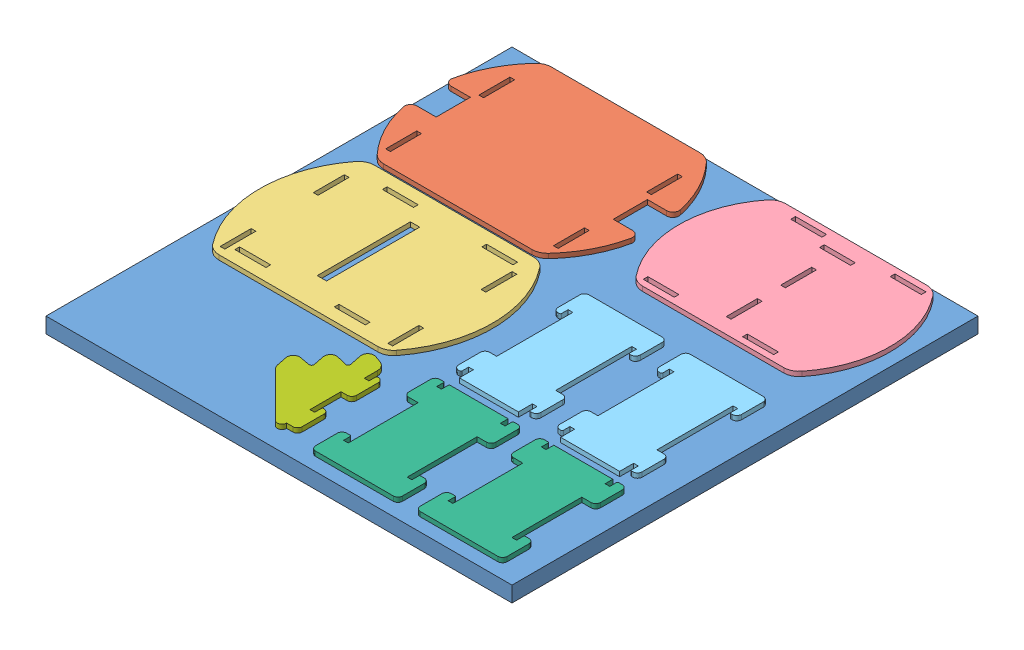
SolidWorks assembly lasercutSheetSim.sldasm, configuration Default (file format 15000). Lengths in mm.
Overall size (300 14.5 300).
9 component instances, 7 part files, 0 mates.
Components (placement in the parent):
- 12by12-1: 12by12.SLDPRT [Default] at (-153.9209 -10.0686 155.5125) size (300 10 300)
- base-2: base.SLDPRT [Default] at (-77.7753 1.4314 -87.531) size (146.79 3 108)
- midPlate-2: midPlate.SLDPRT [Default] at (-76.6708 1.4314 20.165) size (150 3 100)
- topPlate-2: topPlate.SLDPRT [Default] at (71.3421 1.4314 -94.7107) size (136 3 92)
- frontBackPlate-2: frontBackPlate.SLDPRT [Default] at (56.1003 1.4314 61.4035) x (0 0 -1) z (1 0 0) size (88 3 53)
- frontBackPlate-3: frontBackPlate.SLDPRT [Default] at (121.8225 1.4314 61.9558) x (0 0 -1) z (1 0 0) size (88 3 53)
- sidePart-2: sidePart.SLDPRT [Default] at (86.0316 1.4314 148.5309) size (56 3 80)
- sidePart-3: sidePart.SLDPRT [Default] at (18.6526 1.4314 148.5309) size (56 3 80)
- mohawk-2: mohawk.SLDPRT [Default] at (-12.2888 1.4314 149.4718) x (0 0 -1) z (1 0 0) size (69 3 43.79)
